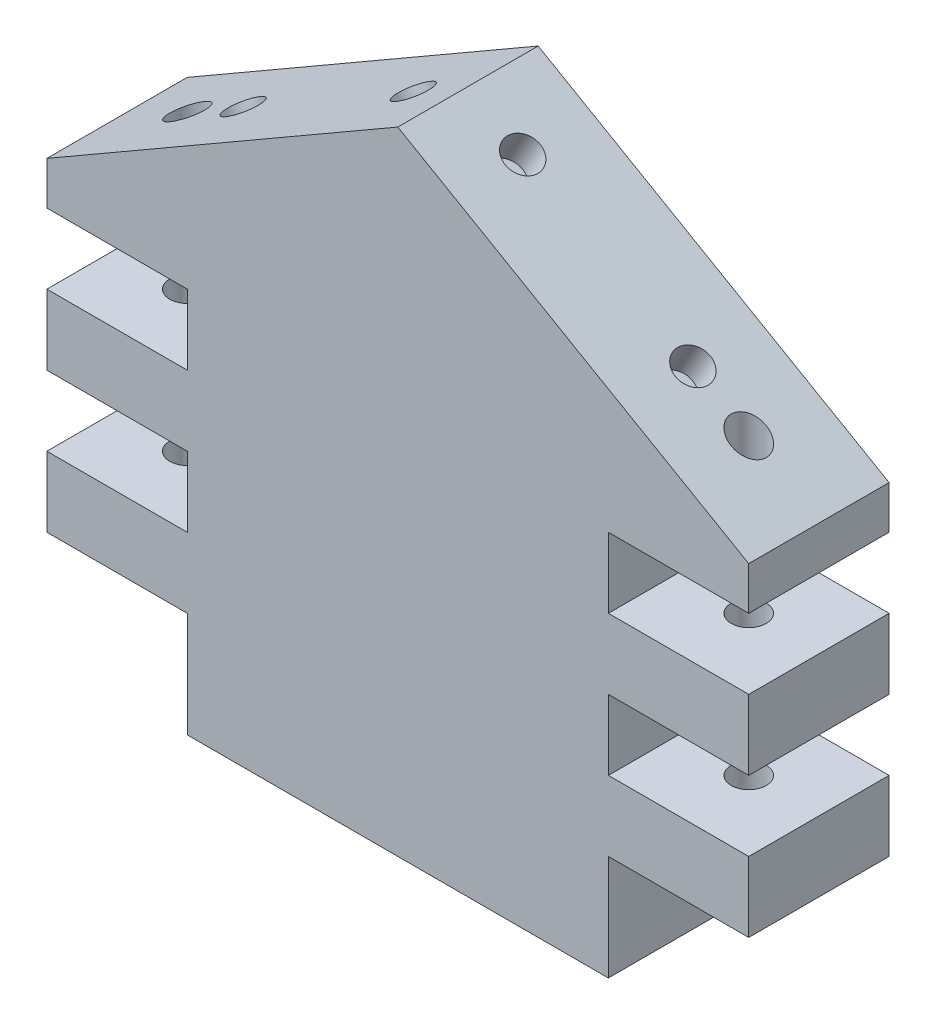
from build123d import *

# Parameters (mm, degrees)
SKETCH1_W               = 100
SKETCH1_H               = 90
BOSS_EXTRUDE1_DEPTH     = 10
SKETCH2_W               = 20
SKETCH2_H               = 15
CUT_EXTRUDE1_DEPTH      = 71.178344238
SKETCH5_W               = 20
SKETCH5_H               = 10
CUT_EXTRUDE9_DEPTH      = 71.178344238
LPATTERN1_COUNT         = 2
LPATTERN1_PITCH         = 20
SKETCH3_R               = 2.5
CUT_EXTRUDE2_DEPTH      = 94.541434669
CUT_EXTRUDE3_DEPTH      = 71.178344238
MIRROR1_COPY_1_SKETCH_W = 20
MIRROR1_COPY_1_SKETCH_H = 10
MIRROR1_COPY_1_DEPTH    = 71.178344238
SKETCH6_R               = 2.5
CUT_EXTRUDE10_DEPTH     = 5
LPATTERN2_COUNT         = 2
LPATTERN2_PITCH         = 28
MIRROR2_COPY_1_SKETCH_R = 2.5
MIRROR2_COPY_1_DEPTH    = 5


with BuildPart() as part:
    # Sketch1 → Boss-Extrude1 (new, symmetric)
    with BuildSketch(Plane.XY):
        Rectangle(SKETCH1_W, SKETCH1_H)
    extrude(amount=BOSS_EXTRUDE1_DEPTH, both=True)

    # Sketch2 → Cut-Extrude1 (cut, through all)
    with BuildSketch(Plane.XY.offset(10)):
        with Locations((40, -37.5)):
            Rectangle(SKETCH2_W, SKETCH2_H)
    cut_extrude1 = extrude(amount=-CUT_EXTRUDE1_DEPTH, mode=Mode.SUBTRACT)

    # Sketch5 → Cut-Extrude9 (cut, through all)
    with BuildSketch(Plane.XY.offset(10)):
        with Locations((40, -15)):
            Rectangle(SKETCH5_W, SKETCH5_H)
    cut_extrude9 = extrude(amount=-CUT_EXTRUDE9_DEPTH, mode=Mode.SUBTRACT)

    # LPattern1: Cut-Extrude9 ×2
    with Locations(*[(0, i * LPATTERN1_PITCH, 0) for i in range(1, LPATTERN1_COUNT)]):
        add(cut_extrude9, mode=Mode.SUBTRACT)

    # Sketch3 → Cut-Extrude2 (cut, through all)
    with BuildSketch(Plane(origin=(-5, -30, 0), x_dir=(-1, 0, 0), z_dir=(0, 1, 0))):
        with Locations((-45, 0)):
            Circle(SKETCH3_R)
    cut_extrude2 = extrude(amount=CUT_EXTRUDE2_DEPTH, mode=Mode.SUBTRACT)

    # Sketch4 → Cut-Extrude3 (cut, through all)
    with BuildSketch(Plane.XY.offset(10)):
        Polygon((50, 16.132486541), (0, 45), (50, 45), align=None)
    cut_extrude3 = extrude(amount=-CUT_EXTRUDE3_DEPTH, mode=Mode.SUBTRACT)

    # Mirror1: Cut-Extrude1, Cut-Extrude9, Cut-Extrude2, Cut-Extrude3 across plane
    add(cut_extrude1.mirror(Plane(origin=(0, 0, 0), x_dir=(0, 0, 1), z_dir=(1, 0, 0))), mode=Mode.SUBTRACT)
    add(cut_extrude9.mirror(Plane(origin=(0, 0, 0), x_dir=(0, 0, 1), z_dir=(1, 0, 0))), mode=Mode.SUBTRACT)
    add(cut_extrude2.mirror(Plane(origin=(0, 0, 0), x_dir=(0, 0, 1), z_dir=(1, 0, 0))), mode=Mode.SUBTRACT)
    add(cut_extrude3.mirror(Plane(origin=(0, 0, 0), x_dir=(0, 0, 1), z_dir=(1, 0, 0))), mode=Mode.SUBTRACT)

    # Mirror1 copy 1 sketch → Mirror1 copy 1 (cut, through all)
    with BuildSketch(Plane(origin=(0, 20, 10), x_dir=(-1, 0, 0), z_dir=(0, 0, 1))):
        with Locations((40, 15)):
            Rectangle(MIRROR1_COPY_1_SKETCH_W, MIRROR1_COPY_1_SKETCH_H)
    extrude(amount=-MIRROR1_COPY_1_DEPTH, mode=Mode.SUBTRACT)

    # Sketch6 → Cut-Extrude10 (cut)
    with BuildSketch(Plane(origin=(19.485571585, 33.75, 0), x_dir=(0.8660254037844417, -0.4999999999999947, 0), z_dir=(0.49999999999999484, 0.8660254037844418, 0))):
        with Locations(Location((-13.5, 0, 0), (0, 0, 180))):
            Circle(SKETCH6_R)
    cut_extrude10 = extrude(amount=-CUT_EXTRUDE10_DEPTH, mode=Mode.SUBTRACT)

    # LPattern2: Cut-Extrude10 ×2
    with Locations(*[Vector(0.8660254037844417, -0.49999999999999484, 0) * (i * LPATTERN2_PITCH) for i in range(1, LPATTERN2_COUNT)]):
        add(cut_extrude10, mode=Mode.SUBTRACT)

    # Mirror2: Cut-Extrude10 across plane
    add(cut_extrude10.mirror(Plane(origin=(0, 0, 0), x_dir=(0, 0, 1), z_dir=(1, 0, 0))), mode=Mode.SUBTRACT)

    # Mirror2 copy 1 sketch → Mirror2 copy 1 (cut)
    with BuildSketch(Plane(origin=(-43.734282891, 19.75, 0), x_dir=(-0.8660254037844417, -0.4999999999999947, 0), z_dir=(-0.49999999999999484, 0.8660254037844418, 0))):
        with Locations((-13.5, 0)):
            Circle(MIRROR2_COPY_1_SKETCH_R)
    extrude(amount=-MIRROR2_COPY_1_DEPTH, mode=Mode.SUBTRACT)


solid = part.part
